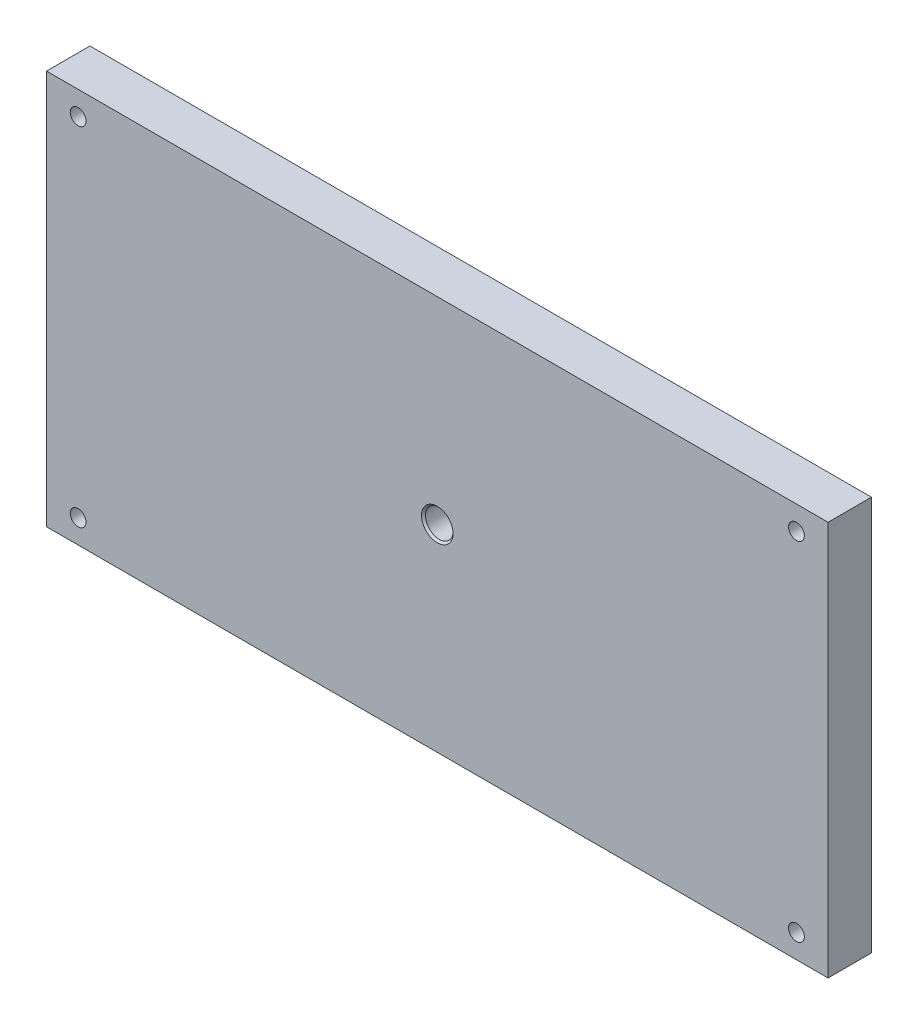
ISO-10303-21;
HEADER;
FILE_DESCRIPTION(('STEP AP214'),'2;1');
FILE_NAME('part.step','',(''),(''),'','','');
FILE_SCHEMA(('AUTOMOTIVE_DESIGN { 1 0 10303 214 1 1 1 1 }'));
ENDSEC;
DATA;
#1=APPLICATION_CONTEXT('core data for automotive mechanical design processes');
#2=APPLICATION_PROTOCOL_DEFINITION('international standard','automotive_design',2000,#1);
#3=PRODUCT_CONTEXT('',#1,'mechanical');
#4=PRODUCT('Part','Part','',(#3));
#5=PRODUCT_RELATED_PRODUCT_CATEGORY('part','',(#4));
#6=PRODUCT_DEFINITION_FORMATION('','',#4);
#7=PRODUCT_DEFINITION_CONTEXT('part definition',#1,'design');
#8=PRODUCT_DEFINITION('design','',#6,#7);
#9=PRODUCT_DEFINITION_SHAPE('','',#8);
#10=(LENGTH_UNIT() NAMED_UNIT(*) SI_UNIT(.MILLI.,.METRE.));
#11=(NAMED_UNIT(*) PLANE_ANGLE_UNIT() SI_UNIT($,.RADIAN.));
#12=(NAMED_UNIT(*) SI_UNIT($,.STERADIAN.) SOLID_ANGLE_UNIT());
#13=UNCERTAINTY_MEASURE_WITH_UNIT(LENGTH_MEASURE(1.E-05),#10,'distance_accuracy_value','');
#14=(GEOMETRIC_REPRESENTATION_CONTEXT(3) GLOBAL_UNCERTAINTY_ASSIGNED_CONTEXT((#13)) GLOBAL_UNIT_ASSIGNED_CONTEXT((#10,
#11,#12)) REPRESENTATION_CONTEXT('',''));
#15=CARTESIAN_POINT('',(0.,0.,0.));
#16=DIRECTION('',(0.,0.,1.));
#17=DIRECTION('',(1.,0.,0.));
#18=AXIS2_PLACEMENT_3D('',#15,#16,#17);
#19=CARTESIAN_POINT('',(-198.,100.,-143.));
#20=DIRECTION('',(0.,1.,0.));
#21=DIRECTION('',(-1.,0.,0.));
#22=AXIS2_PLACEMENT_3D('',#19,#20,#21);
#23=PLANE('',#22);
#24=DIRECTION('',(1.,0.,0.));
#25=VECTOR('',#24,1.);
#26=CARTESIAN_POINT('',(-198.,100.,-165.));
#27=LINE('',#26,#25);
#28=CARTESIAN_POINT('',(-198.,100.,-165.));
#29=VERTEX_POINT('',#28);
#30=CARTESIAN_POINT('',(198.,100.,-165.));
#31=VERTEX_POINT('',#30);
#32=EDGE_CURVE('E237',#29,#31,#27,.T.);
#33=ORIENTED_EDGE('',*,*,#32,.F.);
#34=DIRECTION('',(0.,0.,-1.));
#35=VECTOR('',#34,1.);
#36=CARTESIAN_POINT('',(-198.,100.,-143.));
#37=LINE('',#36,#35);
#38=CARTESIAN_POINT('',(-198.,100.,-143.));
#39=VERTEX_POINT('',#38);
#40=EDGE_CURVE('E65',#39,#29,#37,.T.);
#41=ORIENTED_EDGE('',*,*,#40,.F.);
#42=DIRECTION('',(1.,0.,0.));
#43=VECTOR('',#42,1.);
#44=CARTESIAN_POINT('',(-198.,100.,-143.));
#45=LINE('',#44,#43);
#46=CARTESIAN_POINT('',(198.,100.,-143.));
#47=VERTEX_POINT('',#46);
#48=EDGE_CURVE('E230',#39,#47,#45,.T.);
#49=ORIENTED_EDGE('',*,*,#48,.T.);
#50=DIRECTION('',(0.,0.,-1.));
#51=VECTOR('',#50,1.);
#52=CARTESIAN_POINT('',(198.,100.,-143.));
#53=LINE('',#52,#51);
#54=EDGE_CURVE('E249',#47,#31,#53,.T.);
#55=ORIENTED_EDGE('',*,*,#54,.T.);
#56=EDGE_LOOP('',(#33,#41,#49,#55));
#57=FACE_BOUND('',#56,.T.);
#58=ADVANCED_FACE('F16',(#57),#23,.T.);
#59=CARTESIAN_POINT('',(198.,100.,-143.));
#60=DIRECTION('',(1.,0.,0.));
#61=DIRECTION('',(0.,0.,-1.));
#62=AXIS2_PLACEMENT_3D('',#59,#60,#61);
#63=PLANE('',#62);
#64=DIRECTION('',(0.,-1.,0.));
#65=VECTOR('',#64,1.);
#66=CARTESIAN_POINT('',(198.,100.,-165.));
#67=LINE('',#66,#65);
#68=CARTESIAN_POINT('',(198.,-100.,-165.));
#69=VERTEX_POINT('',#68);
#70=EDGE_CURVE('E240',#31,#69,#67,.T.);
#71=ORIENTED_EDGE('',*,*,#70,.F.);
#72=ORIENTED_EDGE('',*,*,#54,.F.);
#73=DIRECTION('',(0.,-1.,0.));
#74=VECTOR('',#73,1.);
#75=CARTESIAN_POINT('',(198.,100.,-143.));
#76=LINE('',#75,#74);
#77=CARTESIAN_POINT('',(198.,-100.,-143.));
#78=VERTEX_POINT('',#77);
#79=EDGE_CURVE('E233',#47,#78,#76,.T.);
#80=ORIENTED_EDGE('',*,*,#79,.T.);
#81=DIRECTION('',(0.,0.,-1.));
#82=VECTOR('',#81,1.);
#83=CARTESIAN_POINT('',(198.,-100.,-143.));
#84=LINE('',#83,#82);
#85=EDGE_CURVE('E51',#78,#69,#84,.T.);
#86=ORIENTED_EDGE('',*,*,#85,.T.);
#87=EDGE_LOOP('',(#71,#72,#80,#86));
#88=FACE_BOUND('',#87,.T.);
#89=ADVANCED_FACE('F102',(#88),#63,.T.);
#90=CARTESIAN_POINT('',(198.,-100.,-143.));
#91=DIRECTION('',(0.,-1.,0.));
#92=DIRECTION('',(1.,0.,0.));
#93=AXIS2_PLACEMENT_3D('',#90,#91,#92);
#94=PLANE('',#93);
#95=DIRECTION('',(-1.,0.,0.));
#96=VECTOR('',#95,1.);
#97=CARTESIAN_POINT('',(198.,-100.,-165.));
#98=LINE('',#97,#96);
#99=CARTESIAN_POINT('',(-198.,-100.,-165.));
#100=VERTEX_POINT('',#99);
#101=EDGE_CURVE('E243',#69,#100,#98,.T.);
#102=ORIENTED_EDGE('',*,*,#101,.F.);
#103=ORIENTED_EDGE('',*,*,#85,.F.);
#104=DIRECTION('',(-1.,0.,0.));
#105=VECTOR('',#104,1.);
#106=CARTESIAN_POINT('',(198.,-100.,-143.));
#107=LINE('',#106,#105);
#108=CARTESIAN_POINT('',(-198.,-100.,-143.));
#109=VERTEX_POINT('',#108);
#110=EDGE_CURVE('E235',#78,#109,#107,.T.);
#111=ORIENTED_EDGE('',*,*,#110,.T.);
#112=DIRECTION('',(0.,0.,-1.));
#113=VECTOR('',#112,1.);
#114=CARTESIAN_POINT('',(-198.,-100.,-143.));
#115=LINE('',#114,#113);
#116=EDGE_CURVE('E57',#109,#100,#115,.T.);
#117=ORIENTED_EDGE('',*,*,#116,.T.);
#118=EDGE_LOOP('',(#102,#103,#111,#117));
#119=FACE_BOUND('',#118,.T.);
#120=ADVANCED_FACE('F107',(#119),#94,.T.);
#121=CARTESIAN_POINT('',(-198.,-100.,-143.));
#122=DIRECTION('',(-1.,0.,0.));
#123=DIRECTION('',(0.,-1.,0.));
#124=AXIS2_PLACEMENT_3D('',#121,#122,#123);
#125=PLANE('',#124);
#126=DIRECTION('',(0.,1.,0.));
#127=VECTOR('',#126,1.);
#128=CARTESIAN_POINT('',(-198.,-100.,-165.));
#129=LINE('',#128,#127);
#130=EDGE_CURVE('E231',#100,#29,#129,.T.);
#131=ORIENTED_EDGE('',*,*,#130,.F.);
#132=ORIENTED_EDGE('',*,*,#116,.F.);
#133=DIRECTION('',(0.,1.,0.));
#134=VECTOR('',#133,1.);
#135=CARTESIAN_POINT('',(-198.,0.,-143.));
#136=LINE('',#135,#134);
#137=EDGE_CURVE('E33',#109,#39,#136,.T.);
#138=ORIENTED_EDGE('',*,*,#137,.T.);
#139=ORIENTED_EDGE('',*,*,#40,.T.);
#140=EDGE_LOOP('',(#131,#132,#138,#139));
#141=FACE_BOUND('',#140,.T.);
#142=ADVANCED_FACE('F285',(#141),#125,.T.);
#143=CARTESIAN_POINT('',(-198.,100.,-143.));
#144=DIRECTION('',(0.,0.,-1.));
#145=DIRECTION('',(-1.,0.,0.));
#146=AXIS2_PLACEMENT_3D('',#143,#144,#145);
#147=PLANE('',#146);
#148=CARTESIAN_POINT('',(0.,0.,-143.));
#149=DIRECTION('',(0.,0.,-1.));
#150=DIRECTION('',(-1.,0.,0.));
#151=AXIS2_PLACEMENT_3D('',#148,#149,#150);
#152=CIRCLE('',#151,8.);
#153=CARTESIAN_POINT('',(-8.,0.,-143.));
#154=VERTEX_POINT('',#153);
#155=EDGE_CURVE('E131',#154,#154,#152,.T.);
#156=ORIENTED_EDGE('',*,*,#155,.T.);
#157=EDGE_LOOP('',(#156));
#158=FACE_BOUND('',#157,.T.);
#159=CARTESIAN_POINT('',(-182.,-88.,-143.));
#160=DIRECTION('',(0.,0.,-1.));
#161=DIRECTION('',(-1.,0.,0.));
#162=AXIS2_PLACEMENT_3D('',#159,#160,#161);
#163=CIRCLE('',#162,4.);
#164=CARTESIAN_POINT('',(-186.,-88.,-143.));
#165=VERTEX_POINT('',#164);
#166=EDGE_CURVE('E198',#165,#165,#163,.T.);
#167=ORIENTED_EDGE('',*,*,#166,.T.);
#168=EDGE_LOOP('',(#167));
#169=FACE_BOUND('',#168,.T.);
#170=CARTESIAN_POINT('',(-182.,88.,-143.));
#171=DIRECTION('',(0.,0.,-1.));
#172=DIRECTION('',(-1.,0.,0.));
#173=AXIS2_PLACEMENT_3D('',#170,#171,#172);
#174=CIRCLE('',#173,4.);
#175=CARTESIAN_POINT('',(-186.,88.,-143.));
#176=VERTEX_POINT('',#175);
#177=EDGE_CURVE('E208',#176,#176,#174,.T.);
#178=ORIENTED_EDGE('',*,*,#177,.T.);
#179=EDGE_LOOP('',(#178));
#180=FACE_BOUND('',#179,.T.);
#181=CARTESIAN_POINT('',(182.,88.,-143.));
#182=DIRECTION('',(0.,0.,-1.));
#183=DIRECTION('',(-1.,0.,0.));
#184=AXIS2_PLACEMENT_3D('',#181,#182,#183);
#185=CIRCLE('',#184,4.);
#186=CARTESIAN_POINT('',(178.,88.,-143.));
#187=VERTEX_POINT('',#186);
#188=EDGE_CURVE('E218',#187,#187,#185,.T.);
#189=ORIENTED_EDGE('',*,*,#188,.T.);
#190=EDGE_LOOP('',(#189));
#191=FACE_BOUND('',#190,.T.);
#192=CARTESIAN_POINT('',(182.,-88.,-143.));
#193=DIRECTION('',(0.,0.,-1.));
#194=DIRECTION('',(-1.,0.,0.));
#195=AXIS2_PLACEMENT_3D('',#192,#193,#194);
#196=CIRCLE('',#195,4.);
#197=CARTESIAN_POINT('',(178.,-88.,-143.));
#198=VERTEX_POINT('',#197);
#199=EDGE_CURVE('E228',#198,#198,#196,.T.);
#200=ORIENTED_EDGE('',*,*,#199,.T.);
#201=EDGE_LOOP('',(#200));
#202=FACE_BOUND('',#201,.T.);
#203=ORIENTED_EDGE('',*,*,#137,.F.);
#204=ORIENTED_EDGE('',*,*,#110,.F.);
#205=ORIENTED_EDGE('',*,*,#79,.F.);
#206=ORIENTED_EDGE('',*,*,#48,.F.);
#207=EDGE_LOOP('',(#203,#204,#205,#206));
#208=FACE_BOUND('',#207,.T.);
#209=ADVANCED_FACE('F266',(#158,#169,#180,#191,#202,#208),#147,.F.);
#210=CARTESIAN_POINT('',(-198.,100.,-165.));
#211=DIRECTION('',(0.,0.,-1.));
#212=DIRECTION('',(-1.,0.,0.));
#213=AXIS2_PLACEMENT_3D('',#210,#211,#212);
#214=PLANE('',#213);
#215=CARTESIAN_POINT('',(0.,-38.,-165.));
#216=DIRECTION('',(0.,0.,-1.));
#217=DIRECTION('',(-1.,0.,0.));
#218=AXIS2_PLACEMENT_3D('',#215,#216,#217);
#219=CIRCLE('',#218,2.);
#220=CARTESIAN_POINT('',(-2.,-38.,-165.));
#221=VERTEX_POINT('',#220);
#222=EDGE_CURVE('E25',#221,#221,#219,.F.);
#223=ORIENTED_EDGE('',*,*,#222,.T.);
#224=EDGE_LOOP('',(#223));
#225=FACE_BOUND('',#224,.T.);
#226=CARTESIAN_POINT('',(0.,38.,-165.));
#227=DIRECTION('',(0.,0.,-1.));
#228=DIRECTION('',(-1.,0.,0.));
#229=AXIS2_PLACEMENT_3D('',#226,#227,#228);
#230=CIRCLE('',#229,2.);
#231=CARTESIAN_POINT('',(-2.00000000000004,38.,-165.));
#232=VERTEX_POINT('',#231);
#233=EDGE_CURVE('E135',#232,#232,#230,.F.);
#234=ORIENTED_EDGE('',*,*,#233,.T.);
#235=EDGE_LOOP('',(#234));
#236=FACE_BOUND('',#235,.T.);
#237=CARTESIAN_POINT('',(0.,0.,-165.));
#238=DIRECTION('',(0.,0.,-1.));
#239=DIRECTION('',(-1.,0.,0.));
#240=AXIS2_PLACEMENT_3D('',#237,#238,#239);
#241=CIRCLE('',#240,8.);
#242=CARTESIAN_POINT('',(-8.,0.,-165.));
#243=VERTEX_POINT('',#242);
#244=EDGE_CURVE('E138',#243,#243,#241,.F.);
#245=ORIENTED_EDGE('',*,*,#244,.T.);
#246=EDGE_LOOP('',(#245));
#247=FACE_BOUND('',#246,.T.);
#248=CARTESIAN_POINT('',(165.,-88.,-165.));
#249=DIRECTION('',(0.,0.,1.));
#250=DIRECTION('',(1.,0.,0.));
#251=AXIS2_PLACEMENT_3D('',#248,#249,#250);
#252=CIRCLE('',#251,2.);
#253=CARTESIAN_POINT('',(167.,-88.,-165.));
#254=VERTEX_POINT('',#253);
#255=EDGE_CURVE('E163',#254,#254,#252,.T.);
#256=ORIENTED_EDGE('',*,*,#255,.T.);
#257=EDGE_LOOP('',(#256));
#258=FACE_BOUND('',#257,.T.);
#259=CARTESIAN_POINT('',(165.,88.,-165.));
#260=DIRECTION('',(0.,0.,1.));
#261=DIRECTION('',(1.,0.,0.));
#262=AXIS2_PLACEMENT_3D('',#259,#260,#261);
#263=CIRCLE('',#262,2.);
#264=CARTESIAN_POINT('',(167.,88.,-165.));
#265=VERTEX_POINT('',#264);
#266=EDGE_CURVE('E169',#265,#265,#263,.T.);
#267=ORIENTED_EDGE('',*,*,#266,.T.);
#268=EDGE_LOOP('',(#267));
#269=FACE_BOUND('',#268,.T.);
#270=CARTESIAN_POINT('',(-165.,-88.,-165.));
#271=DIRECTION('',(0.,0.,1.));
#272=DIRECTION('',(1.,0.,0.));
#273=AXIS2_PLACEMENT_3D('',#270,#271,#272);
#274=CIRCLE('',#273,2.);
#275=CARTESIAN_POINT('',(-163.,-88.,-165.));
#276=VERTEX_POINT('',#275);
#277=EDGE_CURVE('E175',#276,#276,#274,.T.);
#278=ORIENTED_EDGE('',*,*,#277,.T.);
#279=EDGE_LOOP('',(#278));
#280=FACE_BOUND('',#279,.T.);
#281=CARTESIAN_POINT('',(-165.,88.,-165.));
#282=DIRECTION('',(0.,0.,1.));
#283=DIRECTION('',(1.,0.,0.));
#284=AXIS2_PLACEMENT_3D('',#281,#282,#283);
#285=CIRCLE('',#284,2.);
#286=CARTESIAN_POINT('',(-163.,88.,-165.));
#287=VERTEX_POINT('',#286);
#288=EDGE_CURVE('E181',#287,#287,#285,.T.);
#289=ORIENTED_EDGE('',*,*,#288,.T.);
#290=EDGE_LOOP('',(#289));
#291=FACE_BOUND('',#290,.T.);
#292=CARTESIAN_POINT('',(-182.,-88.,-165.));
#293=DIRECTION('',(0.,0.,1.));
#294=DIRECTION('',(1.,0.,0.));
#295=AXIS2_PLACEMENT_3D('',#292,#293,#294);
#296=CIRCLE('',#295,7.);
#297=CARTESIAN_POINT('',(-175.,-88.,-165.));
#298=VERTEX_POINT('',#297);
#299=EDGE_CURVE('E187',#298,#298,#296,.T.);
#300=ORIENTED_EDGE('',*,*,#299,.T.);
#301=EDGE_LOOP('',(#300));
#302=FACE_BOUND('',#301,.T.);
#303=CARTESIAN_POINT('',(-182.,88.,-165.));
#304=DIRECTION('',(0.,0.,1.));
#305=DIRECTION('',(1.,0.,0.));
#306=AXIS2_PLACEMENT_3D('',#303,#304,#305);
#307=CIRCLE('',#306,7.);
#308=CARTESIAN_POINT('',(-175.,88.,-165.));
#309=VERTEX_POINT('',#308);
#310=EDGE_CURVE('E199',#309,#309,#307,.T.);
#311=ORIENTED_EDGE('',*,*,#310,.T.);
#312=EDGE_LOOP('',(#311));
#313=FACE_BOUND('',#312,.T.);
#314=CARTESIAN_POINT('',(182.,88.,-165.));
#315=DIRECTION('',(0.,0.,1.));
#316=DIRECTION('',(1.,0.,0.));
#317=AXIS2_PLACEMENT_3D('',#314,#315,#316);
#318=CIRCLE('',#317,7.);
#319=CARTESIAN_POINT('',(189.,88.,-165.));
#320=VERTEX_POINT('',#319);
#321=EDGE_CURVE('E209',#320,#320,#318,.T.);
#322=ORIENTED_EDGE('',*,*,#321,.T.);
#323=EDGE_LOOP('',(#322));
#324=FACE_BOUND('',#323,.T.);
#325=CARTESIAN_POINT('',(182.,-88.,-165.));
#326=DIRECTION('',(0.,0.,1.));
#327=DIRECTION('',(1.,0.,0.));
#328=AXIS2_PLACEMENT_3D('',#325,#326,#327);
#329=CIRCLE('',#328,7.);
#330=CARTESIAN_POINT('',(189.,-88.,-165.));
#331=VERTEX_POINT('',#330);
#332=EDGE_CURVE('E219',#331,#331,#329,.T.);
#333=ORIENTED_EDGE('',*,*,#332,.T.);
#334=EDGE_LOOP('',(#333));
#335=FACE_BOUND('',#334,.T.);
#336=ORIENTED_EDGE('',*,*,#130,.T.);
#337=ORIENTED_EDGE('',*,*,#32,.T.);
#338=ORIENTED_EDGE('',*,*,#70,.T.);
#339=ORIENTED_EDGE('',*,*,#101,.T.);
#340=EDGE_LOOP('',(#336,#337,#338,#339));
#341=FACE_BOUND('',#340,.T.);
#342=ADVANCED_FACE('F149',(#225,#236,#247,#258,#269,#280,#291,#302,#313,#324,#335,#341),#214,.T.);
#343=CARTESIAN_POINT('',(182.,-88.,-16.8313082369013));
#344=DIRECTION('',(0.,0.,1.));
#345=DIRECTION('',(1.,0.,0.));
#346=AXIS2_PLACEMENT_3D('',#343,#344,#345);
#347=CYLINDRICAL_SURFACE('',#346,4.);
#348=CARTESIAN_POINT('',(182.,-88.,-157.));
#349=DIRECTION('',(0.,0.,1.));
#350=DIRECTION('',(1.,0.,0.));
#351=AXIS2_PLACEMENT_3D('',#348,#349,#350);
#352=CIRCLE('',#351,4.);
#353=CARTESIAN_POINT('',(186.,-88.,-157.));
#354=VERTEX_POINT('',#353);
#355=EDGE_CURVE('E225',#354,#354,#352,.T.);
#356=ORIENTED_EDGE('',*,*,#355,.F.);
#357=EDGE_LOOP('',(#356));
#358=FACE_BOUND('',#357,.T.);
#359=ORIENTED_EDGE('',*,*,#199,.F.);
#360=EDGE_LOOP('',(#359));
#361=FACE_BOUND('',#360,.T.);
#362=ADVANCED_FACE('F265',(#358,#361),#347,.F.);
#363=CARTESIAN_POINT('',(182.,-88.,-157.));
#364=DIRECTION('',(0.,0.,1.));
#365=DIRECTION('',(1.,0.,0.));
#366=AXIS2_PLACEMENT_3D('',#363,#364,#365);
#367=PLANE('',#366);
#368=ORIENTED_EDGE('',*,*,#355,.T.);
#369=EDGE_LOOP('',(#368));
#370=FACE_BOUND('',#369,.T.);
#371=CARTESIAN_POINT('',(182.,-88.,-157.));
#372=DIRECTION('',(0.,0.,1.));
#373=DIRECTION('',(1.,0.,0.));
#374=AXIS2_PLACEMENT_3D('',#371,#372,#373);
#375=CIRCLE('',#374,7.);
#376=CARTESIAN_POINT('',(189.,-88.,-157.));
#377=VERTEX_POINT('',#376);
#378=EDGE_CURVE('E222',#377,#377,#375,.T.);
#379=ORIENTED_EDGE('',*,*,#378,.F.);
#380=EDGE_LOOP('',(#379));
#381=FACE_BOUND('',#380,.T.);
#382=ADVANCED_FACE('F299',(#370,#381),#367,.F.);
#383=CARTESIAN_POINT('',(182.,-88.,-165.));
#384=DIRECTION('',(0.,0.,1.));
#385=DIRECTION('',(1.,0.,0.));
#386=AXIS2_PLACEMENT_3D('',#383,#384,#385);
#387=CYLINDRICAL_SURFACE('',#386,7.);
#388=ORIENTED_EDGE('',*,*,#378,.T.);
#389=EDGE_LOOP('',(#388));
#390=FACE_BOUND('',#389,.T.);
#391=ORIENTED_EDGE('',*,*,#332,.F.);
#392=EDGE_LOOP('',(#391));
#393=FACE_BOUND('',#392,.T.);
#394=ADVANCED_FACE('F295',(#390,#393),#387,.F.);
#395=CARTESIAN_POINT('',(182.,88.,-16.8313082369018));
#396=DIRECTION('',(0.,0.,1.));
#397=DIRECTION('',(1.,0.,0.));
#398=AXIS2_PLACEMENT_3D('',#395,#396,#397);
#399=CYLINDRICAL_SURFACE('',#398,4.);
#400=CARTESIAN_POINT('',(182.,88.,-157.));
#401=DIRECTION('',(0.,0.,1.));
#402=DIRECTION('',(1.,0.,0.));
#403=AXIS2_PLACEMENT_3D('',#400,#401,#402);
#404=CIRCLE('',#403,4.);
#405=CARTESIAN_POINT('',(186.,88.,-157.));
#406=VERTEX_POINT('',#405);
#407=EDGE_CURVE('E215',#406,#406,#404,.T.);
#408=ORIENTED_EDGE('',*,*,#407,.F.);
#409=EDGE_LOOP('',(#408));
#410=FACE_BOUND('',#409,.T.);
#411=ORIENTED_EDGE('',*,*,#188,.F.);
#412=EDGE_LOOP('',(#411));
#413=FACE_BOUND('',#412,.T.);
#414=ADVANCED_FACE('F298',(#410,#413),#399,.F.);
#415=CARTESIAN_POINT('',(182.,88.,-157.));
#416=DIRECTION('',(0.,0.,1.));
#417=DIRECTION('',(1.,0.,0.));
#418=AXIS2_PLACEMENT_3D('',#415,#416,#417);
#419=PLANE('',#418);
#420=ORIENTED_EDGE('',*,*,#407,.T.);
#421=EDGE_LOOP('',(#420));
#422=FACE_BOUND('',#421,.T.);
#423=CARTESIAN_POINT('',(182.,88.,-157.));
#424=DIRECTION('',(0.,0.,1.));
#425=DIRECTION('',(1.,0.,0.));
#426=AXIS2_PLACEMENT_3D('',#423,#424,#425);
#427=CIRCLE('',#426,7.);
#428=CARTESIAN_POINT('',(189.,88.,-157.));
#429=VERTEX_POINT('',#428);
#430=EDGE_CURVE('E212',#429,#429,#427,.T.);
#431=ORIENTED_EDGE('',*,*,#430,.F.);
#432=EDGE_LOOP('',(#431));
#433=FACE_BOUND('',#432,.T.);
#434=ADVANCED_FACE('F311',(#422,#433),#419,.F.);
#435=CARTESIAN_POINT('',(182.,88.,-165.));
#436=DIRECTION('',(0.,0.,1.));
#437=DIRECTION('',(1.,0.,0.));
#438=AXIS2_PLACEMENT_3D('',#435,#436,#437);
#439=CYLINDRICAL_SURFACE('',#438,7.);
#440=ORIENTED_EDGE('',*,*,#430,.T.);
#441=EDGE_LOOP('',(#440));
#442=FACE_BOUND('',#441,.T.);
#443=ORIENTED_EDGE('',*,*,#321,.F.);
#444=EDGE_LOOP('',(#443));
#445=FACE_BOUND('',#444,.T.);
#446=ADVANCED_FACE('F307',(#442,#445),#439,.F.);
#447=CARTESIAN_POINT('',(-182.,88.,-16.8313082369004));
#448=DIRECTION('',(0.,0.,1.));
#449=DIRECTION('',(1.,0.,0.));
#450=AXIS2_PLACEMENT_3D('',#447,#448,#449);
#451=CYLINDRICAL_SURFACE('',#450,4.);
#452=CARTESIAN_POINT('',(-182.,88.,-157.));
#453=DIRECTION('',(0.,0.,1.));
#454=DIRECTION('',(1.,0.,0.));
#455=AXIS2_PLACEMENT_3D('',#452,#453,#454);
#456=CIRCLE('',#455,4.);
#457=CARTESIAN_POINT('',(-178.,88.,-157.));
#458=VERTEX_POINT('',#457);
#459=EDGE_CURVE('E205',#458,#458,#456,.T.);
#460=ORIENTED_EDGE('',*,*,#459,.F.);
#461=EDGE_LOOP('',(#460));
#462=FACE_BOUND('',#461,.T.);
#463=ORIENTED_EDGE('',*,*,#177,.F.);
#464=EDGE_LOOP('',(#463));
#465=FACE_BOUND('',#464,.T.);
#466=ADVANCED_FACE('F310',(#462,#465),#451,.F.);
#467=CARTESIAN_POINT('',(-182.,88.,-157.));
#468=DIRECTION('',(0.,0.,1.));
#469=DIRECTION('',(1.,0.,0.));
#470=AXIS2_PLACEMENT_3D('',#467,#468,#469);
#471=PLANE('',#470);
#472=ORIENTED_EDGE('',*,*,#459,.T.);
#473=EDGE_LOOP('',(#472));
#474=FACE_BOUND('',#473,.T.);
#475=CARTESIAN_POINT('',(-182.,88.,-157.));
#476=DIRECTION('',(0.,0.,1.));
#477=DIRECTION('',(1.,0.,0.));
#478=AXIS2_PLACEMENT_3D('',#475,#476,#477);
#479=CIRCLE('',#478,7.);
#480=CARTESIAN_POINT('',(-175.,88.,-157.));
#481=VERTEX_POINT('',#480);
#482=EDGE_CURVE('E202',#481,#481,#479,.T.);
#483=ORIENTED_EDGE('',*,*,#482,.F.);
#484=EDGE_LOOP('',(#483));
#485=FACE_BOUND('',#484,.T.);
#486=ADVANCED_FACE('F323',(#474,#485),#471,.F.);
#487=CARTESIAN_POINT('',(-182.,88.,-165.));
#488=DIRECTION('',(0.,0.,1.));
#489=DIRECTION('',(1.,0.,0.));
#490=AXIS2_PLACEMENT_3D('',#487,#488,#489);
#491=CYLINDRICAL_SURFACE('',#490,7.);
#492=ORIENTED_EDGE('',*,*,#482,.T.);
#493=EDGE_LOOP('',(#492));
#494=FACE_BOUND('',#493,.T.);
#495=ORIENTED_EDGE('',*,*,#310,.F.);
#496=EDGE_LOOP('',(#495));
#497=FACE_BOUND('',#496,.T.);
#498=ADVANCED_FACE('F319',(#494,#497),#491,.F.);
#499=CARTESIAN_POINT('',(-182.,-88.,-16.8313082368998));
#500=DIRECTION('',(0.,0.,1.));
#501=DIRECTION('',(1.,0.,0.));
#502=AXIS2_PLACEMENT_3D('',#499,#500,#501);
#503=CYLINDRICAL_SURFACE('',#502,4.);
#504=CARTESIAN_POINT('',(-182.,-88.,-157.));
#505=DIRECTION('',(0.,0.,1.));
#506=DIRECTION('',(1.,0.,0.));
#507=AXIS2_PLACEMENT_3D('',#504,#505,#506);
#508=CIRCLE('',#507,4.);
#509=CARTESIAN_POINT('',(-178.,-88.,-157.));
#510=VERTEX_POINT('',#509);
#511=EDGE_CURVE('E195',#510,#510,#508,.T.);
#512=ORIENTED_EDGE('',*,*,#511,.F.);
#513=EDGE_LOOP('',(#512));
#514=FACE_BOUND('',#513,.T.);
#515=ORIENTED_EDGE('',*,*,#166,.F.);
#516=EDGE_LOOP('',(#515));
#517=FACE_BOUND('',#516,.T.);
#518=ADVANCED_FACE('F322',(#514,#517),#503,.F.);
#519=CARTESIAN_POINT('',(-182.,-88.,-157.));
#520=DIRECTION('',(0.,0.,1.));
#521=DIRECTION('',(1.,0.,0.));
#522=AXIS2_PLACEMENT_3D('',#519,#520,#521);
#523=PLANE('',#522);
#524=ORIENTED_EDGE('',*,*,#511,.T.);
#525=EDGE_LOOP('',(#524));
#526=FACE_BOUND('',#525,.T.);
#527=CARTESIAN_POINT('',(-182.,-88.,-157.));
#528=DIRECTION('',(0.,0.,1.));
#529=DIRECTION('',(1.,0.,0.));
#530=AXIS2_PLACEMENT_3D('',#527,#528,#529);
#531=CIRCLE('',#530,7.);
#532=CARTESIAN_POINT('',(-175.,-88.,-157.));
#533=VERTEX_POINT('',#532);
#534=EDGE_CURVE('E192',#533,#533,#531,.T.);
#535=ORIENTED_EDGE('',*,*,#534,.F.);
#536=EDGE_LOOP('',(#535));
#537=FACE_BOUND('',#536,.T.);
#538=ADVANCED_FACE('F335',(#526,#537),#523,.F.);
#539=CARTESIAN_POINT('',(-182.,-88.,-165.));
#540=DIRECTION('',(0.,0.,1.));
#541=DIRECTION('',(1.,0.,0.));
#542=AXIS2_PLACEMENT_3D('',#539,#540,#541);
#543=CYLINDRICAL_SURFACE('',#542,7.);
#544=ORIENTED_EDGE('',*,*,#534,.T.);
#545=EDGE_LOOP('',(#544));
#546=FACE_BOUND('',#545,.T.);
#547=ORIENTED_EDGE('',*,*,#299,.F.);
#548=EDGE_LOOP('',(#547));
#549=FACE_BOUND('',#548,.T.);
#550=ADVANCED_FACE('F331',(#546,#549),#543,.F.);
#551=CARTESIAN_POINT('',(-165.,88.,-154.));
#552=DIRECTION('',(0.,0.,-1.));
#553=DIRECTION('',(-1.,0.,0.));
#554=AXIS2_PLACEMENT_3D('',#551,#552,#553);
#555=CONICAL_SURFACE('',#554,2.,1.02974425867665);
#556=CARTESIAN_POINT('',(-165.,88.,-154.));
#557=DIRECTION('',(0.,0.,1.));
#558=DIRECTION('',(1.,0.,0.));
#559=AXIS2_PLACEMENT_3D('',#556,#557,#558);
#560=CIRCLE('',#559,2.);
#561=CARTESIAN_POINT('',(-163.,88.,-154.));
#562=VERTEX_POINT('',#561);
#563=EDGE_CURVE('E184',#562,#562,#560,.T.);
#564=ORIENTED_EDGE('',*,*,#563,.F.);
#565=EDGE_LOOP('',(#564));
#566=FACE_BOUND('',#565,.T.);
#567=CARTESIAN_POINT('',(-165.,88.,-152.798278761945));
#568=VERTEX_POINT('',#567);
#569=VERTEX_LOOP('',#568);
#570=FACE_BOUND('',#569,.T.);
#571=ADVANCED_FACE('F334',(#566,#570),#555,.F.);
#572=CARTESIAN_POINT('',(-165.,88.,-165.));
#573=DIRECTION('',(0.,0.,1.));
#574=DIRECTION('',(1.,0.,0.));
#575=AXIS2_PLACEMENT_3D('',#572,#573,#574);
#576=CYLINDRICAL_SURFACE('',#575,2.);
#577=ORIENTED_EDGE('',*,*,#563,.T.);
#578=EDGE_LOOP('',(#577));
#579=FACE_BOUND('',#578,.T.);
#580=ORIENTED_EDGE('',*,*,#288,.F.);
#581=EDGE_LOOP('',(#580));
#582=FACE_BOUND('',#581,.T.);
#583=ADVANCED_FACE('F343',(#579,#582),#576,.F.);
#584=CARTESIAN_POINT('',(-165.,-88.,-154.));
#585=DIRECTION('',(0.,0.,-1.));
#586=DIRECTION('',(-1.,0.,0.));
#587=AXIS2_PLACEMENT_3D('',#584,#585,#586);
#588=CONICAL_SURFACE('',#587,2.,1.02974425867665);
#589=CARTESIAN_POINT('',(-165.,-88.,-154.));
#590=DIRECTION('',(0.,0.,1.));
#591=DIRECTION('',(1.,0.,0.));
#592=AXIS2_PLACEMENT_3D('',#589,#590,#591);
#593=CIRCLE('',#592,2.);
#594=CARTESIAN_POINT('',(-163.,-88.,-154.));
#595=VERTEX_POINT('',#594);
#596=EDGE_CURVE('E178',#595,#595,#593,.T.);
#597=ORIENTED_EDGE('',*,*,#596,.F.);
#598=EDGE_LOOP('',(#597));
#599=FACE_BOUND('',#598,.T.);
#600=CARTESIAN_POINT('',(-165.,-88.,-152.798278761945));
#601=VERTEX_POINT('',#600);
#602=VERTEX_LOOP('',#601);
#603=FACE_BOUND('',#602,.T.);
#604=ADVANCED_FACE('F346',(#599,#603),#588,.F.);
#605=CARTESIAN_POINT('',(-165.,-88.,-165.));
#606=DIRECTION('',(0.,0.,1.));
#607=DIRECTION('',(1.,0.,0.));
#608=AXIS2_PLACEMENT_3D('',#605,#606,#607);
#609=CYLINDRICAL_SURFACE('',#608,2.);
#610=ORIENTED_EDGE('',*,*,#596,.T.);
#611=EDGE_LOOP('',(#610));
#612=FACE_BOUND('',#611,.T.);
#613=ORIENTED_EDGE('',*,*,#277,.F.);
#614=EDGE_LOOP('',(#613));
#615=FACE_BOUND('',#614,.T.);
#616=ADVANCED_FACE('F351',(#612,#615),#609,.F.);
#617=CARTESIAN_POINT('',(165.,88.,-154.));
#618=DIRECTION('',(0.,0.,-1.));
#619=DIRECTION('',(-1.,0.,0.));
#620=AXIS2_PLACEMENT_3D('',#617,#618,#619);
#621=CONICAL_SURFACE('',#620,2.,1.02974425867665);
#622=CARTESIAN_POINT('',(165.,88.,-154.));
#623=DIRECTION('',(0.,0.,1.));
#624=DIRECTION('',(1.,0.,0.));
#625=AXIS2_PLACEMENT_3D('',#622,#623,#624);
#626=CIRCLE('',#625,2.);
#627=CARTESIAN_POINT('',(167.,88.,-154.));
#628=VERTEX_POINT('',#627);
#629=EDGE_CURVE('E172',#628,#628,#626,.T.);
#630=ORIENTED_EDGE('',*,*,#629,.F.);
#631=EDGE_LOOP('',(#630));
#632=FACE_BOUND('',#631,.T.);
#633=CARTESIAN_POINT('',(165.,88.,-152.798278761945));
#634=VERTEX_POINT('',#633);
#635=VERTEX_LOOP('',#634);
#636=FACE_BOUND('',#635,.T.);
#637=ADVANCED_FACE('F354',(#632,#636),#621,.F.);
#638=CARTESIAN_POINT('',(165.,88.,-165.));
#639=DIRECTION('',(0.,0.,1.));
#640=DIRECTION('',(1.,0.,0.));
#641=AXIS2_PLACEMENT_3D('',#638,#639,#640);
#642=CYLINDRICAL_SURFACE('',#641,2.);
#643=ORIENTED_EDGE('',*,*,#629,.T.);
#644=EDGE_LOOP('',(#643));
#645=FACE_BOUND('',#644,.T.);
#646=ORIENTED_EDGE('',*,*,#266,.F.);
#647=EDGE_LOOP('',(#646));
#648=FACE_BOUND('',#647,.T.);
#649=ADVANCED_FACE('F359',(#645,#648),#642,.F.);
#650=CARTESIAN_POINT('',(165.,-88.,-154.));
#651=DIRECTION('',(0.,0.,-1.));
#652=DIRECTION('',(-1.,0.,0.));
#653=AXIS2_PLACEMENT_3D('',#650,#651,#652);
#654=CONICAL_SURFACE('',#653,2.,1.02974425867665);
#655=CARTESIAN_POINT('',(165.,-88.,-154.));
#656=DIRECTION('',(0.,0.,1.));
#657=DIRECTION('',(1.,0.,0.));
#658=AXIS2_PLACEMENT_3D('',#655,#656,#657);
#659=CIRCLE('',#658,2.);
#660=CARTESIAN_POINT('',(167.,-88.,-154.));
#661=VERTEX_POINT('',#660);
#662=EDGE_CURVE('E166',#661,#661,#659,.T.);
#663=ORIENTED_EDGE('',*,*,#662,.F.);
#664=EDGE_LOOP('',(#663));
#665=FACE_BOUND('',#664,.T.);
#666=CARTESIAN_POINT('',(165.,-88.,-152.798278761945));
#667=VERTEX_POINT('',#666);
#668=VERTEX_LOOP('',#667);
#669=FACE_BOUND('',#668,.T.);
#670=ADVANCED_FACE('F362',(#665,#669),#654,.F.);
#671=CARTESIAN_POINT('',(165.,-88.,-165.));
#672=DIRECTION('',(0.,0.,1.));
#673=DIRECTION('',(1.,0.,0.));
#674=AXIS2_PLACEMENT_3D('',#671,#672,#673);
#675=CYLINDRICAL_SURFACE('',#674,2.);
#676=ORIENTED_EDGE('',*,*,#662,.T.);
#677=EDGE_LOOP('',(#676));
#678=FACE_BOUND('',#677,.T.);
#679=ORIENTED_EDGE('',*,*,#255,.F.);
#680=EDGE_LOOP('',(#679));
#681=FACE_BOUND('',#680,.T.);
#682=ADVANCED_FACE('F367',(#678,#681),#675,.F.);
#683=CARTESIAN_POINT('',(0.,0.,-165.));
#684=DIRECTION('',(0.,0.,1.));
#685=DIRECTION('',(1.,0.,0.));
#686=AXIS2_PLACEMENT_3D('',#683,#684,#685);
#687=CYLINDRICAL_SURFACE('',#686,7.);
#688=CARTESIAN_POINT('',(0.,0.,-144.));
#689=DIRECTION('',(0.,0.,-1.));
#690=DIRECTION('',(-1.,0.,0.));
#691=AXIS2_PLACEMENT_3D('',#688,#689,#690);
#692=CIRCLE('',#691,7.);
#693=CARTESIAN_POINT('',(-7.,0.,-144.));
#694=VERTEX_POINT('',#693);
#695=EDGE_CURVE('E128',#694,#694,#692,.F.);
#696=ORIENTED_EDGE('',*,*,#695,.T.);
#697=EDGE_LOOP('',(#696));
#698=FACE_BOUND('',#697,.T.);
#699=CARTESIAN_POINT('',(0.,0.,-164.));
#700=DIRECTION('',(0.,0.,-1.));
#701=DIRECTION('',(-1.,0.,0.));
#702=AXIS2_PLACEMENT_3D('',#699,#700,#701);
#703=CIRCLE('',#702,7.);
#704=CARTESIAN_POINT('',(-7.,0.,-164.));
#705=VERTEX_POINT('',#704);
#706=EDGE_CURVE('E133',#705,#705,#703,.T.);
#707=ORIENTED_EDGE('',*,*,#706,.T.);
#708=EDGE_LOOP('',(#707));
#709=FACE_BOUND('',#708,.T.);
#710=ADVANCED_FACE('F115',(#698,#709),#687,.F.);
#711=CARTESIAN_POINT('',(0.,0.,-165.));
#712=DIRECTION('',(0.,0.,-1.));
#713=DIRECTION('',(-1.,0.,0.));
#714=AXIS2_PLACEMENT_3D('',#711,#712,#713);
#715=CONICAL_SURFACE('',#714,8.,0.785398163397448);
#716=ORIENTED_EDGE('',*,*,#706,.F.);
#717=EDGE_LOOP('',(#716));
#718=FACE_BOUND('',#717,.T.);
#719=ORIENTED_EDGE('',*,*,#244,.F.);
#720=EDGE_LOOP('',(#719));
#721=FACE_BOUND('',#720,.T.);
#722=ADVANCED_FACE('F111',(#718,#721),#715,.F.);
#723=CARTESIAN_POINT('',(0.,0.,-143.));
#724=DIRECTION('',(0.,0.,1.));
#725=DIRECTION('',(1.,0.,0.));
#726=AXIS2_PLACEMENT_3D('',#723,#724,#725);
#727=CONICAL_SURFACE('',#726,8.,0.785398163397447);
#728=ORIENTED_EDGE('',*,*,#695,.F.);
#729=EDGE_LOOP('',(#728));
#730=FACE_BOUND('',#729,.T.);
#731=ORIENTED_EDGE('',*,*,#155,.F.);
#732=EDGE_LOOP('',(#731));
#733=FACE_BOUND('',#732,.T.);
#734=ADVANCED_FACE('F114',(#730,#733),#727,.F.);
#735=CARTESIAN_POINT('',(0.,38.,-156.));
#736=DIRECTION('',(0.,0.,-1.));
#737=DIRECTION('',(-1.,0.,0.));
#738=AXIS2_PLACEMENT_3D('',#735,#736,#737);
#739=CONICAL_SURFACE('',#738,1.65,1.02974425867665);
#740=CARTESIAN_POINT('',(0.,38.,-156.));
#741=DIRECTION('',(0.,0.,1.));
#742=DIRECTION('',(1.,0.,0.));
#743=AXIS2_PLACEMENT_3D('',#740,#741,#742);
#744=CIRCLE('',#743,1.65);
#745=CARTESIAN_POINT('',(1.64999999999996,38.,-156.));
#746=VERTEX_POINT('',#745);
#747=EDGE_CURVE('E160',#746,#746,#744,.T.);
#748=ORIENTED_EDGE('',*,*,#747,.F.);
#749=EDGE_LOOP('',(#748));
#750=FACE_BOUND('',#749,.T.);
#751=CARTESIAN_POINT('',(0.,38.,-155.008579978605));
#752=VERTEX_POINT('',#751);
#753=VERTEX_LOOP('',#752);
#754=FACE_BOUND('',#753,.T.);
#755=ADVANCED_FACE('F118',(#750,#754),#739,.F.);
#756=CARTESIAN_POINT('',(0.,38.,-165.));
#757=DIRECTION('',(0.,0.,1.));
#758=DIRECTION('',(1.,0.,0.));
#759=AXIS2_PLACEMENT_3D('',#756,#757,#758);
#760=CYLINDRICAL_SURFACE('',#759,1.65);
#761=CARTESIAN_POINT('',(0.,38.,-164.65));
#762=DIRECTION('',(0.,0.,-1.));
#763=DIRECTION('',(-1.,0.,0.));
#764=AXIS2_PLACEMENT_3D('',#761,#762,#763);
#765=CIRCLE('',#764,1.65);
#766=CARTESIAN_POINT('',(-1.65000000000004,38.,-164.65));
#767=VERTEX_POINT('',#766);
#768=EDGE_CURVE('E144',#767,#767,#765,.T.);
#769=ORIENTED_EDGE('',*,*,#768,.T.);
#770=EDGE_LOOP('',(#769));
#771=FACE_BOUND('',#770,.T.);
#772=ORIENTED_EDGE('',*,*,#747,.T.);
#773=EDGE_LOOP('',(#772));
#774=FACE_BOUND('',#773,.T.);
#775=ADVANCED_FACE('F98',(#771,#774),#760,.F.);
#776=CARTESIAN_POINT('',(0.,38.,-165.));
#777=DIRECTION('',(0.,0.,-1.));
#778=DIRECTION('',(-1.,0.,0.));
#779=AXIS2_PLACEMENT_3D('',#776,#777,#778);
#780=CONICAL_SURFACE('',#779,2.,0.785398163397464);
#781=ORIENTED_EDGE('',*,*,#768,.F.);
#782=EDGE_LOOP('',(#781));
#783=FACE_BOUND('',#782,.T.);
#784=ORIENTED_EDGE('',*,*,#233,.F.);
#785=EDGE_LOOP('',(#784));
#786=FACE_BOUND('',#785,.T.);
#787=ADVANCED_FACE('F88',(#783,#786),#780,.F.);
#788=CARTESIAN_POINT('',(0.,-38.,-156.));
#789=DIRECTION('',(0.,0.,-1.));
#790=DIRECTION('',(-1.,0.,0.));
#791=AXIS2_PLACEMENT_3D('',#788,#789,#790);
#792=CONICAL_SURFACE('',#791,1.65,1.02974425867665);
#793=CARTESIAN_POINT('',(0.,-38.,-156.));
#794=DIRECTION('',(0.,0.,1.));
#795=DIRECTION('',(1.,0.,0.));
#796=AXIS2_PLACEMENT_3D('',#793,#794,#795);
#797=CIRCLE('',#796,1.65);
#798=CARTESIAN_POINT('',(1.65,-38.,-156.));
#799=VERTEX_POINT('',#798);
#800=EDGE_CURVE('E159',#799,#799,#797,.T.);
#801=ORIENTED_EDGE('',*,*,#800,.F.);
#802=EDGE_LOOP('',(#801));
#803=FACE_BOUND('',#802,.T.);
#804=CARTESIAN_POINT('',(0.,-38.,-155.008579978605));
#805=VERTEX_POINT('',#804);
#806=VERTEX_LOOP('',#805);
#807=FACE_BOUND('',#806,.T.);
#808=ADVANCED_FACE('F85',(#803,#807),#792,.F.);
#809=CARTESIAN_POINT('',(0.,-38.,-165.));
#810=DIRECTION('',(0.,0.,1.));
#811=DIRECTION('',(1.,0.,0.));
#812=AXIS2_PLACEMENT_3D('',#809,#810,#811);
#813=CYLINDRICAL_SURFACE('',#812,1.65);
#814=CARTESIAN_POINT('',(0.,-38.,-164.65));
#815=DIRECTION('',(0.,0.,-1.));
#816=DIRECTION('',(-1.,0.,0.));
#817=AXIS2_PLACEMENT_3D('',#814,#815,#816);
#818=CIRCLE('',#817,1.65);
#819=CARTESIAN_POINT('',(-1.65,-38.,-164.65));
#820=VERTEX_POINT('',#819);
#821=EDGE_CURVE('E11',#820,#820,#818,.T.);
#822=ORIENTED_EDGE('',*,*,#821,.T.);
#823=EDGE_LOOP('',(#822));
#824=FACE_BOUND('',#823,.T.);
#825=ORIENTED_EDGE('',*,*,#800,.T.);
#826=EDGE_LOOP('',(#825));
#827=FACE_BOUND('',#826,.T.);
#828=ADVANCED_FACE('F87',(#824,#827),#813,.F.);
#829=CARTESIAN_POINT('',(0.,-38.,-165.));
#830=DIRECTION('',(0.,0.,-1.));
#831=DIRECTION('',(-1.,0.,0.));
#832=AXIS2_PLACEMENT_3D('',#829,#830,#831);
#833=CONICAL_SURFACE('',#832,2.,0.785398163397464);
#834=ORIENTED_EDGE('',*,*,#821,.F.);
#835=EDGE_LOOP('',(#834));
#836=FACE_BOUND('',#835,.T.);
#837=ORIENTED_EDGE('',*,*,#222,.F.);
#838=EDGE_LOOP('',(#837));
#839=FACE_BOUND('',#838,.T.);
#840=ADVANCED_FACE('F18',(#836,#839),#833,.F.);
#841=CLOSED_SHELL('',(#58,#89,#120,#142,#209,#342,#362,#382,#394,#414,#434,#446,#466,#486,#498,
#518,#538,#550,#571,#583,#604,#616,#637,#649,#670,#682,#710,#722,#734,#755,#775,#787,#808,#828,#840));
#842=MANIFOLD_SOLID_BREP('B1',#841);
#843=ADVANCED_BREP_SHAPE_REPRESENTATION('',(#18,#842),#14);
#844=SHAPE_DEFINITION_REPRESENTATION(#9,#843);
ENDSEC;
END-ISO-10303-21;
